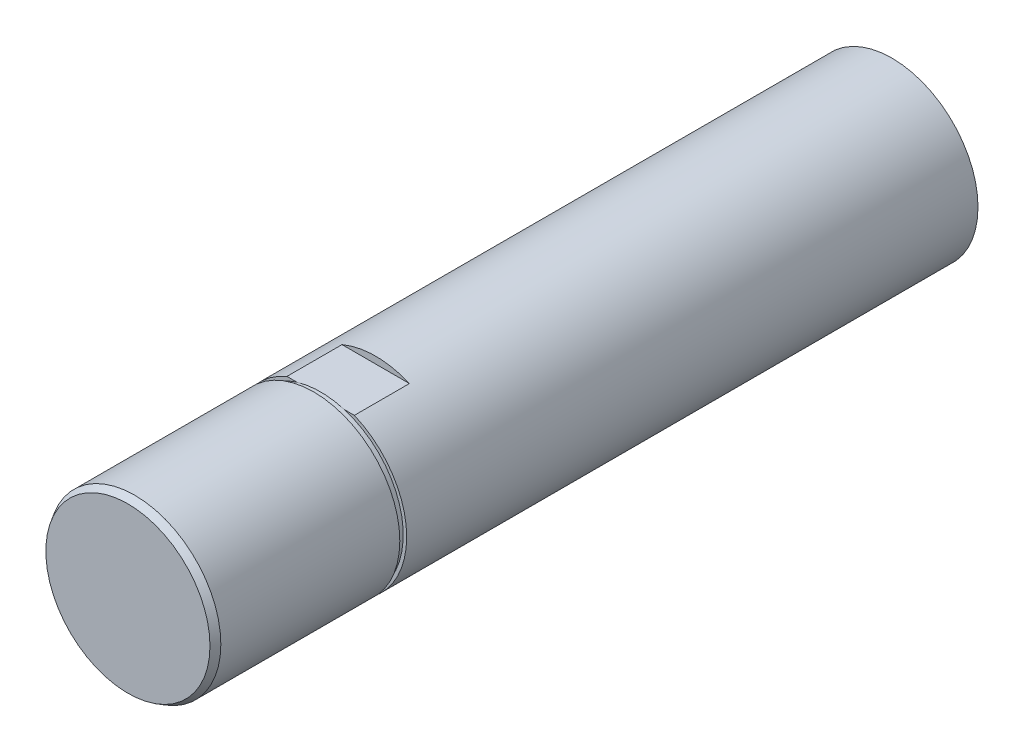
from build123d import *

# Parameters (mm, degrees)
SKETCH1_R        = 12.5
STROKE_DEPTH     = 75
EXTRUDE_START    = 11
SKETCH2_R        = 12.5
EXTRUDE_L2_DEPTH = 11
EXTRUDE_START_2  = 28
SKETCH3_R        = 12.5
EXTRUDE_L3_DEPTH = 28
CHAMFER2_SIZE    = 1
CHAMFER2_SIZE2   = 0.577350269
U_C_START        = 1
SKETCH5_R        = 12.5
SKETCH5_R_2      = 12
U_C_DEPTH        = 1
SKETCH6_W        = 8
SKETCH6_H        = 1.5
A_F_DEPTH        = 10.5


with BuildPart() as part:
    # Sketch1 → STROKE (new body)
    with BuildSketch(Plane.XY):
        Circle(SKETCH1_R)
    extrude(amount=-STROKE_DEPTH)

    # Sketch2 → Extrude L2 (add)
    with BuildSketch(Plane.XY.offset(EXTRUDE_START)):
        Circle(SKETCH2_R)
    extrude(amount=-EXTRUDE_L2_DEPTH)

    # Sketch3 → Extrude L3 (add)
    with BuildSketch(Plane.XY.offset(8).offset(EXTRUDE_START_2)):
        Circle(SKETCH3_R)
    extrude(amount=-EXTRUDE_L3_DEPTH)

    # Chamfer2
    chamfer2_edges = [part.edges().sort_by_distance(p)[0] for p in [
        (-12.5, 0, 36),
    ]]
    chamfer2_side = [part.faces().sort_by_distance(p)[0] for p in [
        (-12.5, 0, -19.5),
    ]]
    chamfer(chamfer2_edges, length=CHAMFER2_SIZE, length2=CHAMFER2_SIZE2, reference=chamfer2_side[0])

    # Sketch5 → U_C (cut)
    with BuildSketch(Plane.XY.offset(8).offset(U_C_START)):
        Circle(SKETCH5_R)
        Circle(SKETCH5_R_2, mode=Mode.SUBTRACT)
    extrude(amount=-U_C_DEPTH, mode=Mode.SUBTRACT)

    # Sketch6 → A_F (cut, symmetric)
    with BuildSketch(Plane(origin=(0, 0, 0), x_dir=(0, 0, -1), z_dir=(1, 0, 0))):
        with Locations((-4, 12.25)):
            Rectangle(SKETCH6_W, SKETCH6_H)
        with Locations((-4, -12.25)):
            Rectangle(SKETCH6_W, SKETCH6_H)
    extrude(amount=A_F_DEPTH, both=True, mode=Mode.SUBTRACT)


solid = part.part
